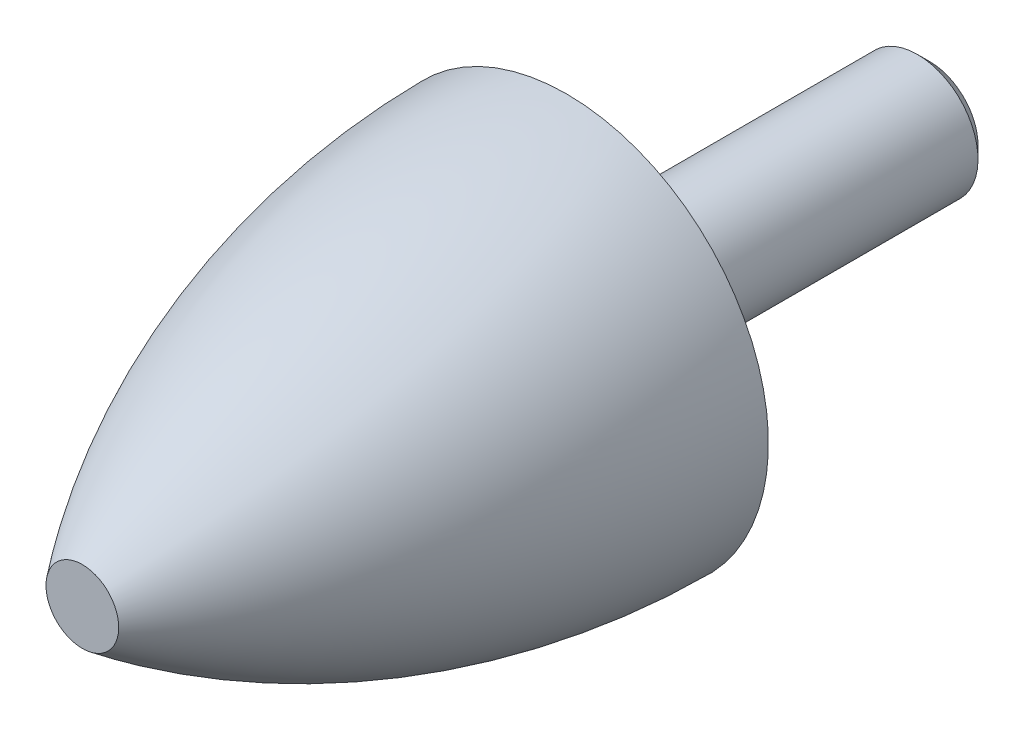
ISO-10303-21;
HEADER;
FILE_DESCRIPTION(('STEP AP214'),'2;1');
FILE_NAME('part.step','',(''),(''),'','','');
FILE_SCHEMA(('AUTOMOTIVE_DESIGN { 1 0 10303 214 1 1 1 1 }'));
ENDSEC;
DATA;
#1=APPLICATION_CONTEXT('core data for automotive mechanical design processes');
#2=APPLICATION_PROTOCOL_DEFINITION('international standard','automotive_design',2000,#1);
#3=PRODUCT_CONTEXT('',#1,'mechanical');
#4=PRODUCT('Part','Part','',(#3));
#5=PRODUCT_RELATED_PRODUCT_CATEGORY('part','',(#4));
#6=PRODUCT_DEFINITION_FORMATION('','',#4);
#7=PRODUCT_DEFINITION_CONTEXT('part definition',#1,'design');
#8=PRODUCT_DEFINITION('design','',#6,#7);
#9=PRODUCT_DEFINITION_SHAPE('','',#8);
#10=(LENGTH_UNIT() NAMED_UNIT(*) SI_UNIT(.MILLI.,.METRE.));
#11=(NAMED_UNIT(*) PLANE_ANGLE_UNIT() SI_UNIT($,.RADIAN.));
#12=(NAMED_UNIT(*) SI_UNIT($,.STERADIAN.) SOLID_ANGLE_UNIT());
#13=UNCERTAINTY_MEASURE_WITH_UNIT(LENGTH_MEASURE(1.E-05),#10,'distance_accuracy_value','');
#14=(GEOMETRIC_REPRESENTATION_CONTEXT(3) GLOBAL_UNCERTAINTY_ASSIGNED_CONTEXT((#13)) GLOBAL_UNIT_ASSIGNED_CONTEXT((#10,
#11,#12)) REPRESENTATION_CONTEXT('',''));
#15=CARTESIAN_POINT('',(0.,0.,0.));
#16=DIRECTION('',(0.,0.,1.));
#17=DIRECTION('',(1.,0.,0.));
#18=AXIS2_PLACEMENT_3D('',#15,#16,#17);
#19=CARTESIAN_POINT('',(10.,0.,-1.39753660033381E-13));
#20=DIRECTION('',(0.,0.,1.));
#21=DIRECTION('',(0.,-1.,0.));
#22=AXIS2_PLACEMENT_3D('',#19,#20,#21);
#23=PLANE('',#22);
#24=CARTESIAN_POINT('',(0.,0.,0.));
#25=DIRECTION('',(0.,0.,-1.));
#26=DIRECTION('',(0.,1.,0.));
#27=AXIS2_PLACEMENT_3D('',#24,#25,#26);
#28=CIRCLE('',#27,3.);
#29=CARTESIAN_POINT('',(0.,3.,0.));
#30=VERTEX_POINT('',#29);
#31=EDGE_CURVE('E23',#30,#30,#28,.T.);
#32=ORIENTED_EDGE('',*,*,#31,.F.);
#33=EDGE_LOOP('',(#32));
#34=FACE_BOUND('',#33,.T.);
#35=CARTESIAN_POINT('',(0.,0.,-2.79507320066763E-13));
#36=DIRECTION('',(0.,0.,-1.));
#37=DIRECTION('',(0.,1.,0.));
#38=AXIS2_PLACEMENT_3D('',#35,#36,#37);
#39=CIRCLE('',#38,10.);
#40=CARTESIAN_POINT('',(0.,10.,-2.79507320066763E-13));
#41=VERTEX_POINT('',#40);
#42=EDGE_CURVE('E19',#41,#41,#39,.T.);
#43=ORIENTED_EDGE('',*,*,#42,.T.);
#44=EDGE_LOOP('',(#43));
#45=FACE_BOUND('',#44,.T.);
#46=ADVANCED_FACE('F12',(#34,#45),#23,.F.);
#47=CARTESIAN_POINT('',(0.,0.,24.));
#48=DIRECTION('',(0.,0.,-1.));
#49=DIRECTION('',(0.,1.,0.));
#50=AXIS2_PLACEMENT_3D('',#47,#48,#49);
#51=PLANE('',#50);
#52=CARTESIAN_POINT('',(0.,0.,24.));
#53=DIRECTION('',(0.,0.,-1.));
#54=DIRECTION('',(0.,1.,0.));
#55=AXIS2_PLACEMENT_3D('',#52,#53,#54);
#56=CIRCLE('',#55,1.80180180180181);
#57=CARTESIAN_POINT('',(0.,1.80180180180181,24.));
#58=VERTEX_POINT('',#57);
#59=EDGE_CURVE('E8',#58,#58,#56,.T.);
#60=ORIENTED_EDGE('',*,*,#59,.F.);
#61=EDGE_LOOP('',(#60));
#62=FACE_BOUND('',#61,.T.);
#63=ADVANCED_FACE('F14',(#62),#51,.F.);
#64=CARTESIAN_POINT('',(0.,0.,-0.263150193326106));
#65=DIRECTION('',(0.,0.,-1.));
#66=DIRECTION('',(0.,1.,0.));
#67=AXIS2_PLACEMENT_3D('',#64,#65,#66);
#68=DEGENERATE_TOROIDAL_SURFACE('',#67,29.9991343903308,40.,.F.);
#69=ORIENTED_EDGE('',*,*,#59,.T.);
#70=EDGE_LOOP('',(#69));
#71=FACE_BOUND('',#70,.T.);
#72=ORIENTED_EDGE('',*,*,#42,.F.);
#73=EDGE_LOOP('',(#72));
#74=FACE_BOUND('',#73,.T.);
#75=ADVANCED_FACE('F47',(#71,#74),#68,.F.);
#76=CARTESIAN_POINT('',(0.,0.,-18.));
#77=DIRECTION('',(0.,0.,-1.));
#78=DIRECTION('',(0.,1.,0.));
#79=AXIS2_PLACEMENT_3D('',#76,#77,#78);
#80=CYLINDRICAL_SURFACE('',#79,3.);
#81=CARTESIAN_POINT('',(0.,0.,-17.3865));
#82=DIRECTION('',(0.,0.,-1.));
#83=DIRECTION('',(0.,1.,0.));
#84=AXIS2_PLACEMENT_3D('',#81,#82,#83);
#85=CIRCLE('',#84,3.);
#86=CARTESIAN_POINT('',(0.,3.,-17.3865));
#87=VERTEX_POINT('',#86);
#88=EDGE_CURVE('E27',#87,#87,#85,.T.);
#89=ORIENTED_EDGE('',*,*,#88,.F.);
#90=EDGE_LOOP('',(#89));
#91=FACE_BOUND('',#90,.T.);
#92=ORIENTED_EDGE('',*,*,#31,.T.);
#93=EDGE_LOOP('',(#92));
#94=FACE_BOUND('',#93,.T.);
#95=ADVANCED_FACE('F41',(#91,#94),#80,.T.);
#96=CARTESIAN_POINT('',(0.,0.,-17.3865));
#97=DIRECTION('',(0.,0.,1.));
#98=DIRECTION('',(0.,-1.,0.));
#99=AXIS2_PLACEMENT_3D('',#96,#97,#98);
#100=CONICAL_SURFACE('',#99,3.,0.785398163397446);
#101=CARTESIAN_POINT('',(0.,0.,-18.));
#102=DIRECTION('',(0.,0.,-1.));
#103=DIRECTION('',(0.,1.,0.));
#104=AXIS2_PLACEMENT_3D('',#101,#102,#103);
#105=CIRCLE('',#104,2.3865);
#106=CARTESIAN_POINT('',(0.,2.3865,-18.));
#107=VERTEX_POINT('',#106);
#108=EDGE_CURVE('E32',#107,#107,#105,.T.);
#109=ORIENTED_EDGE('',*,*,#108,.F.);
#110=EDGE_LOOP('',(#109));
#111=FACE_BOUND('',#110,.T.);
#112=ORIENTED_EDGE('',*,*,#88,.T.);
#113=EDGE_LOOP('',(#112));
#114=FACE_BOUND('',#113,.T.);
#115=ADVANCED_FACE('F38',(#111,#114),#100,.T.);
#116=CARTESIAN_POINT('',(2.3865,0.,-18.));
#117=DIRECTION('',(0.,0.,1.));
#118=DIRECTION('',(0.,-1.,0.));
#119=AXIS2_PLACEMENT_3D('',#116,#117,#118);
#120=PLANE('',#119);
#121=ORIENTED_EDGE('',*,*,#108,.T.);
#122=EDGE_LOOP('',(#121));
#123=FACE_BOUND('',#122,.T.);
#124=ADVANCED_FACE('F36',(#123),#120,.F.);
#125=CLOSED_SHELL('',(#46,#63,#75,#95,#115,#124));
#126=MANIFOLD_SOLID_BREP('B1',#125);
#127=ADVANCED_BREP_SHAPE_REPRESENTATION('',(#18,#126),#14);
#128=SHAPE_DEFINITION_REPRESENTATION(#9,#127);
ENDSEC;
END-ISO-10303-21;
